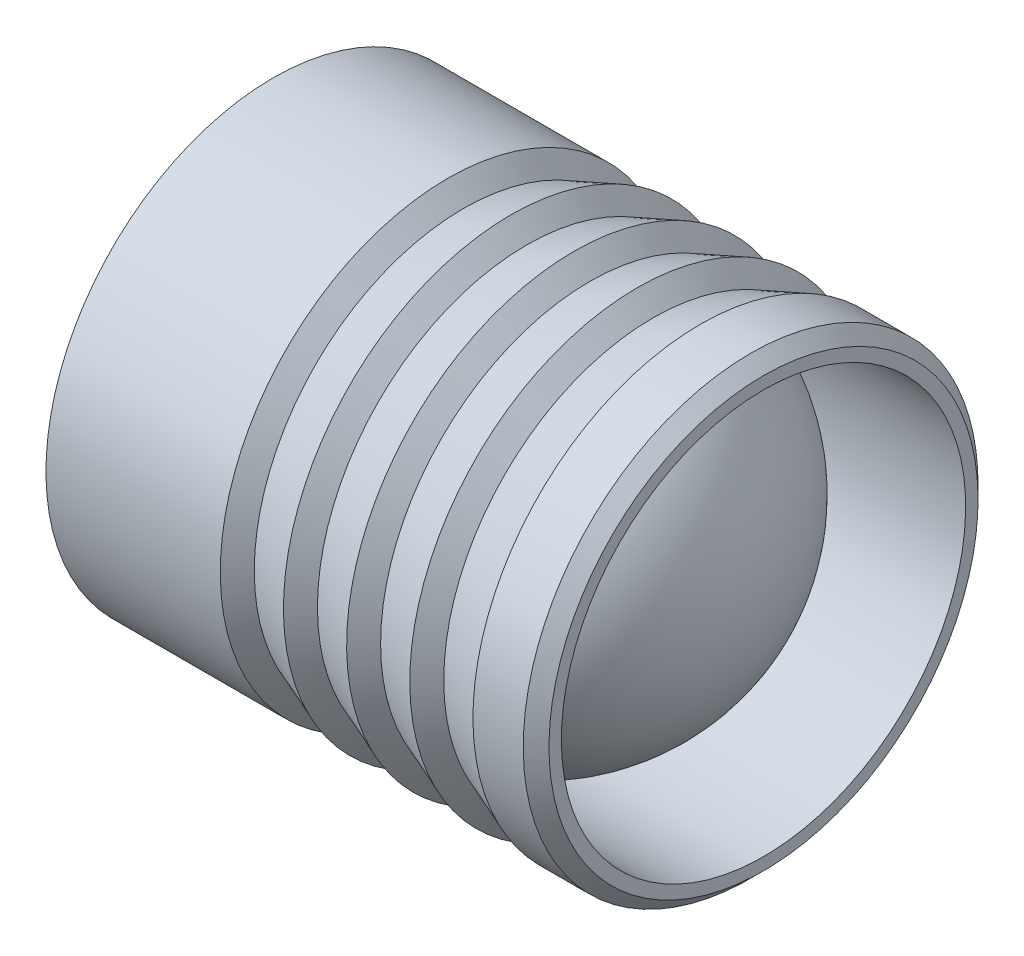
ISO-10303-21;
HEADER;
FILE_DESCRIPTION(('STEP AP214'),'2;1');
FILE_NAME('part.step','',(''),(''),'','','');
FILE_SCHEMA(('AUTOMOTIVE_DESIGN { 1 0 10303 214 1 1 1 1 }'));
ENDSEC;
DATA;
#1=APPLICATION_CONTEXT('core data for automotive mechanical design processes');
#2=APPLICATION_PROTOCOL_DEFINITION('international standard','automotive_design',2000,#1);
#3=PRODUCT_CONTEXT('',#1,'mechanical');
#4=PRODUCT('Part','Part','',(#3));
#5=PRODUCT_RELATED_PRODUCT_CATEGORY('part','',(#4));
#6=PRODUCT_DEFINITION_FORMATION('','',#4);
#7=PRODUCT_DEFINITION_CONTEXT('part definition',#1,'design');
#8=PRODUCT_DEFINITION('design','',#6,#7);
#9=PRODUCT_DEFINITION_SHAPE('','',#8);
#10=(LENGTH_UNIT() NAMED_UNIT(*) SI_UNIT(.MILLI.,.METRE.));
#11=(NAMED_UNIT(*) PLANE_ANGLE_UNIT() SI_UNIT($,.RADIAN.));
#12=(NAMED_UNIT(*) SI_UNIT($,.STERADIAN.) SOLID_ANGLE_UNIT());
#13=UNCERTAINTY_MEASURE_WITH_UNIT(LENGTH_MEASURE(1.E-05),#10,'distance_accuracy_value','');
#14=(GEOMETRIC_REPRESENTATION_CONTEXT(3) GLOBAL_UNCERTAINTY_ASSIGNED_CONTEXT((#13)) GLOBAL_UNIT_ASSIGNED_CONTEXT((#10,
#11,#12)) REPRESENTATION_CONTEXT('',''));
#15=CARTESIAN_POINT('',(0.,0.,0.));
#16=DIRECTION('',(0.,0.,1.));
#17=DIRECTION('',(1.,0.,0.));
#18=AXIS2_PLACEMENT_3D('',#15,#16,#17);
#19=CARTESIAN_POINT('',(5.59,0.,0.));
#20=DIRECTION('',(1.,0.,0.));
#21=DIRECTION('',(0.,-1.,0.));
#22=AXIS2_PLACEMENT_3D('',#19,#20,#21);
#23=SPHERICAL_SURFACE('',#22,4.01);
#24=CARTESIAN_POINT('',(5.8730208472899,0.,0.));
#25=DIRECTION('',(-1.,0.,0.));
#26=DIRECTION('',(0.,-1.,0.));
#27=AXIS2_PLACEMENT_3D('',#24,#25,#26);
#28=CIRCLE('',#27,3.9999999);
#29=CARTESIAN_POINT('',(5.87302084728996,-3.99999989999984,0.));
#30=VERTEX_POINT('',#29);
#31=EDGE_CURVE('E41',#30,#30,#28,.T.);
#32=ORIENTED_EDGE('',*,*,#31,.F.);
#33=EDGE_LOOP('',(#32));
#34=FACE_BOUND('',#33,.T.);
#35=CARTESIAN_POINT('',(9.6,0.,0.));
#36=VERTEX_POINT('',#35);
#37=VERTEX_LOOP('',#36);
#38=FACE_BOUND('',#37,.T.);
#39=ADVANCED_FACE('F18',(#34,#38),#23,.T.);
#40=CARTESIAN_POINT('',(10.,4.24544155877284,0.));
#41=DIRECTION('',(-1.,0.,0.));
#42=DIRECTION('',(0.,1.,0.));
#43=AXIS2_PLACEMENT_3D('',#40,#41,#42);
#44=PLANE('',#43);
#45=CARTESIAN_POINT('',(10.,1.3500311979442E-13,0.));
#46=DIRECTION('',(1.,0.,0.));
#47=DIRECTION('',(0.,1.,0.));
#48=AXIS2_PLACEMENT_3D('',#45,#46,#47);
#49=CIRCLE('',#48,4.2454415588);
#50=CARTESIAN_POINT('',(10.,4.24544155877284,0.));
#51=VERTEX_POINT('',#50);
#52=EDGE_CURVE('E11',#51,#51,#49,.T.);
#53=ORIENTED_EDGE('',*,*,#52,.T.);
#54=EDGE_LOOP('',(#53));
#55=FACE_BOUND('',#54,.T.);
#56=CARTESIAN_POINT('',(10.,1.3500311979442E-13,0.));
#57=DIRECTION('',(1.,0.,0.));
#58=DIRECTION('',(0.,1.,0.));
#59=AXIS2_PLACEMENT_3D('',#56,#57,#58);
#60=CIRCLE('',#59,3.9999999);
#61=CARTESIAN_POINT('',(10.,3.99999989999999,0.));
#62=VERTEX_POINT('',#61);
#63=EDGE_CURVE('E29',#62,#62,#60,.T.);
#64=ORIENTED_EDGE('',*,*,#63,.F.);
#65=EDGE_LOOP('',(#64));
#66=FACE_BOUND('',#65,.T.);
#67=ADVANCED_FACE('F186',(#55,#66),#44,.F.);
#68=CARTESIAN_POINT('',(10.,1.35003119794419E-13,0.));
#69=DIRECTION('',(-1.,0.,0.));
#70=DIRECTION('',(0.,1.,0.));
#71=AXIS2_PLACEMENT_3D('',#68,#69,#70);
#72=CYLINDRICAL_SURFACE('',#71,3.9999999);
#73=ORIENTED_EDGE('',*,*,#63,.T.);
#74=EDGE_LOOP('',(#73));
#75=FACE_BOUND('',#74,.T.);
#76=ORIENTED_EDGE('',*,*,#31,.T.);
#77=EDGE_LOOP('',(#76));
#78=FACE_BOUND('',#77,.T.);
#79=ADVANCED_FACE('F183',(#75,#78),#72,.F.);
#80=CARTESIAN_POINT('',(0.,0.,0.));
#81=DIRECTION('',(1.,0.,0.));
#82=DIRECTION('',(0.,1.,0.));
#83=AXIS2_PLACEMENT_3D('',#80,#81,#82);
#84=PLANE('',#83);
#85=CARTESIAN_POINT('',(0.,0.,0.));
#86=DIRECTION('',(1.,0.,0.));
#87=DIRECTION('',(0.,1.,0.));
#88=AXIS2_PLACEMENT_3D('',#85,#86,#87);
#89=CIRCLE('',#88,3.9803847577);
#90=CARTESIAN_POINT('',(0.,3.98038475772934,0.));
#91=VERTEX_POINT('',#90);
#92=EDGE_CURVE('E150',#91,#91,#89,.T.);
#93=ORIENTED_EDGE('',*,*,#92,.F.);
#94=EDGE_LOOP('',(#93));
#95=FACE_BOUND('',#94,.T.);
#96=ADVANCED_FACE('F195',(#95),#84,.F.);
#97=CARTESIAN_POINT('',(9.74544155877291,1.31385626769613E-13,0.));
#98=DIRECTION('',(-1.,0.,0.));
#99=DIRECTION('',(0.,-1.,0.));
#100=AXIS2_PLACEMENT_3D('',#97,#98,#99);
#101=CONICAL_SURFACE('',#100,4.5,0.7853981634);
#102=CARTESIAN_POINT('',(9.74544155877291,1.31385626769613E-13,0.));
#103=DIRECTION('',(1.,0.,0.));
#104=DIRECTION('',(0.,1.,0.));
#105=AXIS2_PLACEMENT_3D('',#102,#103,#104);
#106=CIRCLE('',#105,4.5);
#107=CARTESIAN_POINT('',(9.74544155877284,4.5,0.));
#108=VERTEX_POINT('',#107);
#109=EDGE_CURVE('E158',#108,#108,#106,.T.);
#110=ORIENTED_EDGE('',*,*,#109,.T.);
#111=EDGE_LOOP('',(#110));
#112=FACE_BOUND('',#111,.T.);
#113=ORIENTED_EDGE('',*,*,#52,.F.);
#114=EDGE_LOOP('',(#113));
#115=FACE_BOUND('',#114,.T.);
#116=ADVANCED_FACE('F208',(#112,#115),#101,.T.);
#117=CARTESIAN_POINT('',(10.,1.35003119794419E-13,0.));
#118=DIRECTION('',(-1.,0.,0.));
#119=DIRECTION('',(0.,1.,0.));
#120=AXIS2_PLACEMENT_3D('',#117,#118,#119);
#121=CYLINDRICAL_SURFACE('',#120,4.5);
#122=CARTESIAN_POINT('',(8.75,1.17239551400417E-13,0.));
#123=DIRECTION('',(1.,0.,0.));
#124=DIRECTION('',(0.,1.,0.));
#125=AXIS2_PLACEMENT_3D('',#122,#123,#124);
#126=CIRCLE('',#125,4.5);
#127=CARTESIAN_POINT('',(8.75,4.5,0.));
#128=VERTEX_POINT('',#127);
#129=EDGE_CURVE('E146',#128,#128,#126,.T.);
#130=ORIENTED_EDGE('',*,*,#129,.T.);
#131=EDGE_LOOP('',(#130));
#132=FACE_BOUND('',#131,.T.);
#133=ORIENTED_EDGE('',*,*,#109,.F.);
#134=EDGE_LOOP('',(#133));
#135=FACE_BOUND('',#134,.T.);
#136=ADVANCED_FACE('F200',(#132,#135),#121,.T.);
#137=CARTESIAN_POINT('',(7.8125,1.03916875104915E-13,0.));
#138=DIRECTION('',(1.,0.,0.));
#139=DIRECTION('',(0.,1.,0.));
#140=AXIS2_PLACEMENT_3D('',#137,#138,#139);
#141=CONICAL_SURFACE('',#140,4.14,0.3666376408);
#142=ORIENTED_EDGE('',*,*,#129,.F.);
#143=EDGE_LOOP('',(#142));
#144=FACE_BOUND('',#143,.T.);
#145=CARTESIAN_POINT('',(7.8125,1.03916875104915E-13,0.));
#146=DIRECTION('',(1.,0.,0.));
#147=DIRECTION('',(0.,1.,0.));
#148=AXIS2_PLACEMENT_3D('',#145,#146,#147);
#149=CIRCLE('',#148,4.14);
#150=CARTESIAN_POINT('',(7.8125,4.14,0.));
#151=VERTEX_POINT('',#150);
#152=EDGE_CURVE('E139',#151,#151,#149,.T.);
#153=ORIENTED_EDGE('',*,*,#152,.T.);
#154=EDGE_LOOP('',(#153));
#155=FACE_BOUND('',#154,.T.);
#156=ADVANCED_FACE('F224',(#144,#155),#141,.T.);
#157=CARTESIAN_POINT('',(7.5,0.,0.));
#158=DIRECTION('',(-1.,0.,0.));
#159=DIRECTION('',(0.,-1.,0.));
#160=AXIS2_PLACEMENT_3D('',#157,#158,#159);
#161=CONICAL_SURFACE('',#160,4.5,0.855913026);
#162=CARTESIAN_POINT('',(7.5,0.,0.));
#163=DIRECTION('',(1.,0.,0.));
#164=DIRECTION('',(0.,1.,0.));
#165=AXIS2_PLACEMENT_3D('',#162,#163,#164);
#166=CIRCLE('',#165,4.5);
#167=CARTESIAN_POINT('',(7.5,4.5,0.));
#168=VERTEX_POINT('',#167);
#169=EDGE_CURVE('E131',#168,#168,#166,.T.);
#170=ORIENTED_EDGE('',*,*,#169,.T.);
#171=EDGE_LOOP('',(#170));
#172=FACE_BOUND('',#171,.T.);
#173=ORIENTED_EDGE('',*,*,#152,.F.);
#174=EDGE_LOOP('',(#173));
#175=FACE_BOUND('',#174,.T.);
#176=ADVANCED_FACE('F20',(#172,#175),#161,.T.);
#177=CARTESIAN_POINT('',(6.5625,0.,0.));
#178=DIRECTION('',(1.,0.,0.));
#179=DIRECTION('',(0.,1.,0.));
#180=AXIS2_PLACEMENT_3D('',#177,#178,#179);
#181=CONICAL_SURFACE('',#180,4.14,0.3666376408);
#182=ORIENTED_EDGE('',*,*,#169,.F.);
#183=EDGE_LOOP('',(#182));
#184=FACE_BOUND('',#183,.T.);
#185=CARTESIAN_POINT('',(6.5625,0.,0.));
#186=DIRECTION('',(1.,0.,0.));
#187=DIRECTION('',(0.,1.,0.));
#188=AXIS2_PLACEMENT_3D('',#185,#186,#187);
#189=CIRCLE('',#188,4.14);
#190=CARTESIAN_POINT('',(6.5625,4.14,0.));
#191=VERTEX_POINT('',#190);
#192=EDGE_CURVE('E127',#191,#191,#189,.T.);
#193=ORIENTED_EDGE('',*,*,#192,.T.);
#194=EDGE_LOOP('',(#193));
#195=FACE_BOUND('',#194,.T.);
#196=ADVANCED_FACE('F235',(#184,#195),#181,.T.);
#197=CARTESIAN_POINT('',(6.25,0.,0.));
#198=DIRECTION('',(-1.,0.,0.));
#199=DIRECTION('',(0.,-1.,0.));
#200=AXIS2_PLACEMENT_3D('',#197,#198,#199);
#201=CONICAL_SURFACE('',#200,4.5,0.855913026);
#202=CARTESIAN_POINT('',(6.25,0.,0.));
#203=DIRECTION('',(1.,0.,0.));
#204=DIRECTION('',(0.,1.,0.));
#205=AXIS2_PLACEMENT_3D('',#202,#203,#204);
#206=CIRCLE('',#205,4.5);
#207=CARTESIAN_POINT('',(6.25,4.5,0.));
#208=VERTEX_POINT('',#207);
#209=EDGE_CURVE('E132',#208,#208,#206,.T.);
#210=ORIENTED_EDGE('',*,*,#209,.T.);
#211=EDGE_LOOP('',(#210));
#212=FACE_BOUND('',#211,.T.);
#213=ORIENTED_EDGE('',*,*,#192,.F.);
#214=EDGE_LOOP('',(#213));
#215=FACE_BOUND('',#214,.T.);
#216=ADVANCED_FACE('F128',(#212,#215),#201,.T.);
#217=CARTESIAN_POINT('',(5.31250000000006,0.,0.));
#218=DIRECTION('',(1.,0.,0.));
#219=DIRECTION('',(0.,1.,0.));
#220=AXIS2_PLACEMENT_3D('',#217,#218,#219);
#221=CONICAL_SURFACE('',#220,4.14,0.3666376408);
#222=ORIENTED_EDGE('',*,*,#209,.F.);
#223=EDGE_LOOP('',(#222));
#224=FACE_BOUND('',#223,.T.);
#225=CARTESIAN_POINT('',(5.31250000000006,0.,0.));
#226=DIRECTION('',(1.,0.,0.));
#227=DIRECTION('',(0.,1.,0.));
#228=AXIS2_PLACEMENT_3D('',#225,#226,#227);
#229=CIRCLE('',#228,4.14);
#230=CARTESIAN_POINT('',(5.3125,4.14,0.));
#231=VERTEX_POINT('',#230);
#232=EDGE_CURVE('E105',#231,#231,#229,.T.);
#233=ORIENTED_EDGE('',*,*,#232,.T.);
#234=EDGE_LOOP('',(#233));
#235=FACE_BOUND('',#234,.T.);
#236=ADVANCED_FACE('F214',(#224,#235),#221,.T.);
#237=CARTESIAN_POINT('',(5.00000000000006,0.,0.));
#238=DIRECTION('',(-1.,0.,0.));
#239=DIRECTION('',(0.,-1.,0.));
#240=AXIS2_PLACEMENT_3D('',#237,#238,#239);
#241=CONICAL_SURFACE('',#240,4.5,0.855913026);
#242=CARTESIAN_POINT('',(5.00000000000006,0.,0.));
#243=DIRECTION('',(1.,0.,0.));
#244=DIRECTION('',(0.,1.,0.));
#245=AXIS2_PLACEMENT_3D('',#242,#243,#244);
#246=CIRCLE('',#245,4.5);
#247=CARTESIAN_POINT('',(5.,4.5,0.));
#248=VERTEX_POINT('',#247);
#249=EDGE_CURVE('E116',#248,#248,#246,.T.);
#250=ORIENTED_EDGE('',*,*,#249,.T.);
#251=EDGE_LOOP('',(#250));
#252=FACE_BOUND('',#251,.T.);
#253=ORIENTED_EDGE('',*,*,#232,.F.);
#254=EDGE_LOOP('',(#253));
#255=FACE_BOUND('',#254,.T.);
#256=ADVANCED_FACE('F210',(#252,#255),#241,.T.);
#257=CARTESIAN_POINT('',(4.06250000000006,0.,0.));
#258=DIRECTION('',(1.,0.,0.));
#259=DIRECTION('',(0.,1.,0.));
#260=AXIS2_PLACEMENT_3D('',#257,#258,#259);
#261=CONICAL_SURFACE('',#260,4.14,0.3666376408);
#262=ORIENTED_EDGE('',*,*,#249,.F.);
#263=EDGE_LOOP('',(#262));
#264=FACE_BOUND('',#263,.T.);
#265=CARTESIAN_POINT('',(4.06250000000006,0.,0.));
#266=DIRECTION('',(1.,0.,0.));
#267=DIRECTION('',(0.,1.,0.));
#268=AXIS2_PLACEMENT_3D('',#265,#266,#267);
#269=CIRCLE('',#268,4.14);
#270=CARTESIAN_POINT('',(4.0625,4.14,0.));
#271=VERTEX_POINT('',#270);
#272=EDGE_CURVE('E160',#271,#271,#269,.T.);
#273=ORIENTED_EDGE('',*,*,#272,.T.);
#274=EDGE_LOOP('',(#273));
#275=FACE_BOUND('',#274,.T.);
#276=ADVANCED_FACE('F213',(#264,#275),#261,.T.);
#277=CARTESIAN_POINT('',(3.75000000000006,0.,0.));
#278=DIRECTION('',(-1.,0.,0.));
#279=DIRECTION('',(0.,-1.,0.));
#280=AXIS2_PLACEMENT_3D('',#277,#278,#279);
#281=CONICAL_SURFACE('',#280,4.5,0.855913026);
#282=CARTESIAN_POINT('',(3.75000000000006,0.,0.));
#283=DIRECTION('',(1.,0.,0.));
#284=DIRECTION('',(0.,1.,0.));
#285=AXIS2_PLACEMENT_3D('',#282,#283,#284);
#286=CIRCLE('',#285,4.5);
#287=CARTESIAN_POINT('',(3.75,4.5,0.));
#288=VERTEX_POINT('',#287);
#289=EDGE_CURVE('E156',#288,#288,#286,.T.);
#290=ORIENTED_EDGE('',*,*,#289,.T.);
#291=EDGE_LOOP('',(#290));
#292=FACE_BOUND('',#291,.T.);
#293=ORIENTED_EDGE('',*,*,#272,.F.);
#294=EDGE_LOOP('',(#293));
#295=FACE_BOUND('',#294,.T.);
#296=ADVANCED_FACE('F228',(#292,#295),#281,.T.);
#297=CARTESIAN_POINT('',(10.,1.35003119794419E-13,0.));
#298=DIRECTION('',(-1.,0.,0.));
#299=DIRECTION('',(0.,1.,0.));
#300=AXIS2_PLACEMENT_3D('',#297,#298,#299);
#301=CYLINDRICAL_SURFACE('',#300,4.5);
#302=CARTESIAN_POINT('',(0.300000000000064,0.,0.));
#303=DIRECTION('',(1.,0.,0.));
#304=DIRECTION('',(0.,1.,0.));
#305=AXIS2_PLACEMENT_3D('',#302,#303,#304);
#306=CIRCLE('',#305,4.5);
#307=CARTESIAN_POINT('',(0.3,4.5,0.));
#308=VERTEX_POINT('',#307);
#309=EDGE_CURVE('E152',#308,#308,#306,.T.);
#310=ORIENTED_EDGE('',*,*,#309,.T.);
#311=EDGE_LOOP('',(#310));
#312=FACE_BOUND('',#311,.T.);
#313=ORIENTED_EDGE('',*,*,#289,.F.);
#314=EDGE_LOOP('',(#313));
#315=FACE_BOUND('',#314,.T.);
#316=ADVANCED_FACE('F204',(#312,#315),#301,.T.);
#317=CARTESIAN_POINT('',(0.,0.,0.));
#318=DIRECTION('',(1.,0.,0.));
#319=DIRECTION('',(0.,1.,0.));
#320=AXIS2_PLACEMENT_3D('',#317,#318,#319);
#321=CONICAL_SURFACE('',#320,3.9803847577,1.0471975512);
#322=ORIENTED_EDGE('',*,*,#309,.F.);
#323=EDGE_LOOP('',(#322));
#324=FACE_BOUND('',#323,.T.);
#325=ORIENTED_EDGE('',*,*,#92,.T.);
#326=EDGE_LOOP('',(#325));
#327=FACE_BOUND('',#326,.T.);
#328=ADVANCED_FACE('F201',(#324,#327),#321,.T.);
#329=CLOSED_SHELL('',(#39,#67,#79,#96,#116,#136,#156,#176,#196,#216,#236,#256,#276,#296,#316,#328));
#330=CARTESIAN_POINT('',(2.80940101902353,0.,0.));
#331=DIRECTION('',(1.,0.,0.));
#332=DIRECTION('',(0.,1.,0.));
#333=AXIS2_PLACEMENT_3D('',#330,#331,#332);
#334=CONICAL_SURFACE('',#333,3.9999999,1.0471975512);
#335=CARTESIAN_POINT('',(2.80940101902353,0.,0.));
#336=DIRECTION('',(1.,0.,0.));
#337=DIRECTION('',(0.,1.,0.));
#338=AXIS2_PLACEMENT_3D('',#335,#336,#337);
#339=CIRCLE('',#338,3.9999999);
#340=CARTESIAN_POINT('',(2.80940101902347,3.9999999,0.));
#341=VERTEX_POINT('',#340);
#342=EDGE_CURVE('E148',#341,#341,#339,.T.);
#343=ORIENTED_EDGE('',*,*,#342,.T.);
#344=EDGE_LOOP('',(#343));
#345=FACE_BOUND('',#344,.T.);
#346=CARTESIAN_POINT('',(0.5,0.,0.));
#347=VERTEX_POINT('',#346);
#348=VERTEX_LOOP('',#347);
#349=FACE_BOUND('',#348,.T.);
#350=ADVANCED_FACE('F218',(#345,#349),#334,.F.);
#351=CARTESIAN_POINT('',(5.59,0.,0.));
#352=DIRECTION('',(1.,0.,0.));
#353=DIRECTION('',(0.,-1.,0.));
#354=AXIS2_PLACEMENT_3D('',#351,#352,#353);
#355=SPHERICAL_SURFACE('',#354,4.01);
#356=CARTESIAN_POINT('',(5.3069791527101,0.,0.));
#357=DIRECTION('',(1.,0.,0.));
#358=DIRECTION('',(0.,1.,0.));
#359=AXIS2_PLACEMENT_3D('',#356,#357,#358);
#360=CIRCLE('',#359,3.9999999);
#361=CARTESIAN_POINT('',(5.30697915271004,3.99999989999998,0.));
#362=VERTEX_POINT('',#361);
#363=EDGE_CURVE('E22',#362,#362,#360,.T.);
#364=ORIENTED_EDGE('',*,*,#363,.F.);
#365=EDGE_LOOP('',(#364));
#366=FACE_BOUND('',#365,.T.);
#367=CARTESIAN_POINT('',(1.58,0.,0.));
#368=VERTEX_POINT('',#367);
#369=VERTEX_LOOP('',#368);
#370=FACE_BOUND('',#369,.T.);
#371=ADVANCED_FACE('F221',(#366,#370),#355,.T.);
#372=CARTESIAN_POINT('',(10.,1.35003119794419E-13,0.));
#373=DIRECTION('',(-1.,0.,0.));
#374=DIRECTION('',(0.,1.,0.));
#375=AXIS2_PLACEMENT_3D('',#372,#373,#374);
#376=CYLINDRICAL_SURFACE('',#375,3.9999999);
#377=ORIENTED_EDGE('',*,*,#363,.T.);
#378=EDGE_LOOP('',(#377));
#379=FACE_BOUND('',#378,.T.);
#380=ORIENTED_EDGE('',*,*,#342,.F.);
#381=EDGE_LOOP('',(#380));
#382=FACE_BOUND('',#381,.T.);
#383=ADVANCED_FACE('F239',(#379,#382),#376,.F.);
#384=CLOSED_SHELL('',(#350,#371,#383));
#385=ORIENTED_CLOSED_SHELL('',*,#384,.T.);
#386=BREP_WITH_VOIDS('B1',#329,(#385));
#387=ADVANCED_BREP_SHAPE_REPRESENTATION('',(#18,#386),#14);
#388=SHAPE_DEFINITION_REPRESENTATION(#9,#387);
ENDSEC;
END-ISO-10303-21;
